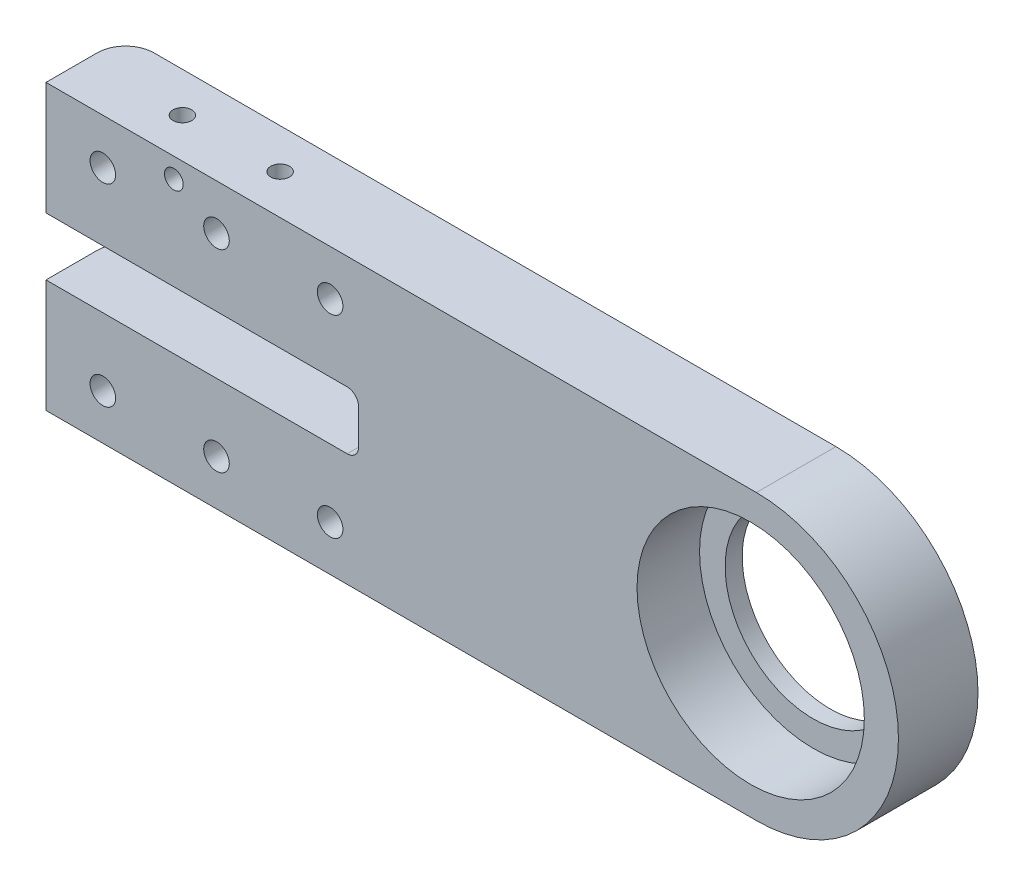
ISO-10303-21;
HEADER;
FILE_DESCRIPTION(('STEP AP214'),'2;1');
FILE_NAME('part.step','',(''),(''),'','','');
FILE_SCHEMA(('AUTOMOTIVE_DESIGN { 1 0 10303 214 1 1 1 1 }'));
ENDSEC;
DATA;
#1=APPLICATION_CONTEXT('core data for automotive mechanical design processes');
#2=APPLICATION_PROTOCOL_DEFINITION('international standard','automotive_design',2000,#1);
#3=PRODUCT_CONTEXT('',#1,'mechanical');
#4=PRODUCT('Part','Part','',(#3));
#5=PRODUCT_RELATED_PRODUCT_CATEGORY('part','',(#4));
#6=PRODUCT_DEFINITION_FORMATION('','',#4);
#7=PRODUCT_DEFINITION_CONTEXT('part definition',#1,'design');
#8=PRODUCT_DEFINITION('design','',#6,#7);
#9=PRODUCT_DEFINITION_SHAPE('','',#8);
#10=(LENGTH_UNIT() NAMED_UNIT(*) SI_UNIT(.MILLI.,.METRE.));
#11=(NAMED_UNIT(*) PLANE_ANGLE_UNIT() SI_UNIT($,.RADIAN.));
#12=(NAMED_UNIT(*) SI_UNIT($,.STERADIAN.) SOLID_ANGLE_UNIT());
#13=UNCERTAINTY_MEASURE_WITH_UNIT(LENGTH_MEASURE(1.E-05),#10,'distance_accuracy_value','');
#14=(GEOMETRIC_REPRESENTATION_CONTEXT(3) GLOBAL_UNCERTAINTY_ASSIGNED_CONTEXT((#13)) GLOBAL_UNIT_ASSIGNED_CONTEXT((#10,
#11,#12)) REPRESENTATION_CONTEXT('',''));
#15=CARTESIAN_POINT('',(0.,0.,0.));
#16=DIRECTION('',(0.,0.,1.));
#17=DIRECTION('',(1.,0.,0.));
#18=AXIS2_PLACEMENT_3D('',#15,#16,#17);
#19=CARTESIAN_POINT('',(0.,-50.,14.));
#20=DIRECTION('',(-1.,0.,0.));
#21=DIRECTION('',(0.,-1.,0.));
#22=AXIS2_PLACEMENT_3D('',#19,#20,#21);
#23=PLANE('',#22);
#24=DIRECTION('',(0.,0.,-1.));
#25=VECTOR('',#24,1.);
#26=CARTESIAN_POINT('',(0.,0.,14.));
#27=LINE('',#26,#25);
#28=CARTESIAN_POINT('',(0.,0.,14.));
#29=VERTEX_POINT('',#28);
#30=CARTESIAN_POINT('',(0.,0.,5.));
#31=VERTEX_POINT('',#30);
#32=EDGE_CURVE('E173',#29,#31,#27,.T.);
#33=ORIENTED_EDGE('',*,*,#32,.T.);
#34=DIRECTION('',(0.,1.,0.));
#35=VECTOR('',#34,1.);
#36=CARTESIAN_POINT('',(0.,-50.,5.));
#37=LINE('',#36,#35);
#38=CARTESIAN_POINT('',(0.,-19.8999999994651,5.));
#39=VERTEX_POINT('',#38);
#40=EDGE_CURVE('E41',#31,#39,#37,.F.);
#41=ORIENTED_EDGE('',*,*,#40,.T.);
#42=DIRECTION('',(0.,0.,1.));
#43=VECTOR('',#42,1.);
#44=CARTESIAN_POINT('',(0.,-19.8999999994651,0.));
#45=LINE('',#44,#43);
#46=CARTESIAN_POINT('',(0.,-19.8999999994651,14.));
#47=VERTEX_POINT('',#46);
#48=EDGE_CURVE('E132',#39,#47,#45,.T.);
#49=ORIENTED_EDGE('',*,*,#48,.T.);
#50=DIRECTION('',(0.,1.,0.));
#51=VECTOR('',#50,1.);
#52=CARTESIAN_POINT('',(0.,-50.,14.));
#53=LINE('',#52,#51);
#54=EDGE_CURVE('E151',#47,#29,#53,.T.);
#55=ORIENTED_EDGE('',*,*,#54,.T.);
#56=EDGE_LOOP('',(#33,#41,#49,#55));
#57=FACE_BOUND('',#56,.T.);
#58=ADVANCED_FACE('F33',(#57),#23,.T.);
#59=CARTESIAN_POINT('',(125.,-25.,14.));
#60=DIRECTION('',(0.,0.,-1.));
#61=DIRECTION('',(-1.,0.,0.));
#62=AXIS2_PLACEMENT_3D('',#59,#60,#61);
#63=CYLINDRICAL_SURFACE('',#62,25.);
#64=CARTESIAN_POINT('',(125.,-25.,0.));
#65=DIRECTION('',(0.,0.,-1.));
#66=DIRECTION('',(-1.,0.,0.));
#67=AXIS2_PLACEMENT_3D('',#64,#65,#66);
#68=CIRCLE('',#67,25.);
#69=CARTESIAN_POINT('',(125.,0.,0.));
#70=VERTEX_POINT('',#69);
#71=CARTESIAN_POINT('',(125.,-50.,0.));
#72=VERTEX_POINT('',#71);
#73=EDGE_CURVE('E160',#70,#72,#68,.T.);
#74=ORIENTED_EDGE('',*,*,#73,.F.);
#75=DIRECTION('',(0.,0.,-1.));
#76=VECTOR('',#75,1.);
#77=CARTESIAN_POINT('',(125.,0.,14.));
#78=LINE('',#77,#76);
#79=CARTESIAN_POINT('',(125.,0.,14.));
#80=VERTEX_POINT('',#79);
#81=EDGE_CURVE('E169',#80,#70,#78,.T.);
#82=ORIENTED_EDGE('',*,*,#81,.F.);
#83=CARTESIAN_POINT('',(125.,-25.,14.));
#84=DIRECTION('',(0.,0.,-1.));
#85=DIRECTION('',(-1.,0.,0.));
#86=AXIS2_PLACEMENT_3D('',#83,#84,#85);
#87=CIRCLE('',#86,25.);
#88=CARTESIAN_POINT('',(125.,-50.,14.));
#89=VERTEX_POINT('',#88);
#90=EDGE_CURVE('E168',#80,#89,#87,.T.);
#91=ORIENTED_EDGE('',*,*,#90,.T.);
#92=DIRECTION('',(0.,0.,-1.));
#93=VECTOR('',#92,1.);
#94=CARTESIAN_POINT('',(125.,-50.,14.));
#95=LINE('',#94,#93);
#96=EDGE_CURVE('E154',#89,#72,#95,.T.);
#97=ORIENTED_EDGE('',*,*,#96,.T.);
#98=EDGE_LOOP('',(#74,#82,#91,#97));
#99=FACE_BOUND('',#98,.T.);
#100=ADVANCED_FACE('F261',(#99),#63,.T.);
#101=CARTESIAN_POINT('',(0.,0.,14.));
#102=DIRECTION('',(0.,1.,0.));
#103=DIRECTION('',(0.,0.,1.));
#104=AXIS2_PLACEMENT_3D('',#101,#102,#103);
#105=PLANE('',#104);
#106=CARTESIAN_POINT('',(17.,0.,7.00000000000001));
#107=DIRECTION('',(0.,1.,0.));
#108=DIRECTION('',(0.,0.,1.));
#109=AXIS2_PLACEMENT_3D('',#106,#107,#108);
#110=CIRCLE('',#109,1.64999999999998);
#111=CARTESIAN_POINT('',(17.,0.,8.64999999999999));
#112=VERTEX_POINT('',#111);
#113=EDGE_CURVE('E368',#112,#112,#110,.T.);
#114=ORIENTED_EDGE('',*,*,#113,.F.);
#115=EDGE_LOOP('',(#114));
#116=FACE_BOUND('',#115,.T.);
#117=CARTESIAN_POINT('',(34.2,0.,7.00000000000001));
#118=DIRECTION('',(0.,1.,0.));
#119=DIRECTION('',(0.,0.,1.));
#120=AXIS2_PLACEMENT_3D('',#117,#118,#119);
#121=CIRCLE('',#120,1.64999999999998);
#122=CARTESIAN_POINT('',(34.2,0.,8.64999999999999));
#123=VERTEX_POINT('',#122);
#124=EDGE_CURVE('E374',#123,#123,#121,.T.);
#125=ORIENTED_EDGE('',*,*,#124,.F.);
#126=EDGE_LOOP('',(#125));
#127=FACE_BOUND('',#126,.T.);
#128=DIRECTION('',(1.,0.,0.));
#129=VECTOR('',#128,1.);
#130=CARTESIAN_POINT('',(0.,0.,0.));
#131=LINE('',#130,#129);
#132=CARTESIAN_POINT('',(5.,0.,0.));
#133=VERTEX_POINT('',#132);
#134=EDGE_CURVE('E166',#133,#70,#131,.T.);
#135=ORIENTED_EDGE('',*,*,#134,.F.);
#136=CARTESIAN_POINT('',(5.,0.,5.));
#137=DIRECTION('',(0.,1.,0.));
#138=DIRECTION('',(0.,0.,1.));
#139=AXIS2_PLACEMENT_3D('',#136,#137,#138);
#140=CIRCLE('',#139,5.);
#141=EDGE_CURVE('E55',#133,#31,#140,.T.);
#142=ORIENTED_EDGE('',*,*,#141,.T.);
#143=ORIENTED_EDGE('',*,*,#32,.F.);
#144=DIRECTION('',(1.,0.,0.));
#145=VECTOR('',#144,1.);
#146=CARTESIAN_POINT('',(0.,0.,14.));
#147=LINE('',#146,#145);
#148=EDGE_CURVE('E150',#29,#80,#147,.T.);
#149=ORIENTED_EDGE('',*,*,#148,.T.);
#150=ORIENTED_EDGE('',*,*,#81,.T.);
#151=EDGE_LOOP('',(#135,#142,#143,#149,#150));
#152=FACE_BOUND('',#151,.T.);
#153=ADVANCED_FACE('F266',(#116,#127,#152),#105,.T.);
#154=DIRECTION('',(0.,0.,1.));
#155=VECTOR('',#154,1.);
#156=CARTESIAN_POINT('',(0.,-30.0999999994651,0.));
#157=LINE('',#156,#155);
#158=CARTESIAN_POINT('',(0.,-30.0999999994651,5.));
#159=VERTEX_POINT('',#158);
#160=CARTESIAN_POINT('',(0.,-30.0999999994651,14.));
#161=VERTEX_POINT('',#160);
#162=EDGE_CURVE('E121',#159,#161,#157,.T.);
#163=ORIENTED_EDGE('',*,*,#162,.F.);
#164=DIRECTION('',(0.,1.,0.));
#165=VECTOR('',#164,1.);
#166=CARTESIAN_POINT('',(0.,-50.,5.));
#167=LINE('',#166,#165);
#168=CARTESIAN_POINT('',(0.,-50.,5.));
#169=VERTEX_POINT('',#168);
#170=EDGE_CURVE('E236',#159,#169,#167,.F.);
#171=ORIENTED_EDGE('',*,*,#170,.T.);
#172=DIRECTION('',(0.,0.,-1.));
#173=VECTOR('',#172,1.);
#174=CARTESIAN_POINT('',(0.,-50.,14.));
#175=LINE('',#174,#173);
#176=CARTESIAN_POINT('',(0.,-50.,14.));
#177=VERTEX_POINT('',#176);
#178=EDGE_CURVE('E149',#177,#169,#175,.T.);
#179=ORIENTED_EDGE('',*,*,#178,.F.);
#180=EDGE_CURVE('E140',#177,#161,#53,.T.);
#181=ORIENTED_EDGE('',*,*,#180,.T.);
#182=EDGE_LOOP('',(#163,#171,#179,#181));
#183=FACE_BOUND('',#182,.T.);
#184=ADVANCED_FACE('F147',(#183),#23,.T.);
#185=CARTESIAN_POINT('',(125.,-50.,14.));
#186=DIRECTION('',(0.,-1.,0.));
#187=DIRECTION('',(0.,0.,-1.));
#188=AXIS2_PLACEMENT_3D('',#185,#186,#187);
#189=PLANE('',#188);
#190=ORIENTED_EDGE('',*,*,#178,.T.);
#191=CARTESIAN_POINT('',(5.00000000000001,-50.,5.));
#192=DIRECTION('',(0.,-1.,0.));
#193=DIRECTION('',(0.,0.,-1.));
#194=AXIS2_PLACEMENT_3D('',#191,#192,#193);
#195=CIRCLE('',#194,5.);
#196=CARTESIAN_POINT('',(5.,-50.,0.));
#197=VERTEX_POINT('',#196);
#198=EDGE_CURVE('E238',#169,#197,#195,.T.);
#199=ORIENTED_EDGE('',*,*,#198,.T.);
#200=DIRECTION('',(-1.,0.,0.));
#201=VECTOR('',#200,1.);
#202=CARTESIAN_POINT('',(125.,-50.,0.));
#203=LINE('',#202,#201);
#204=EDGE_CURVE('E163',#72,#197,#203,.T.);
#205=ORIENTED_EDGE('',*,*,#204,.F.);
#206=ORIENTED_EDGE('',*,*,#96,.F.);
#207=DIRECTION('',(-1.,0.,0.));
#208=VECTOR('',#207,1.);
#209=CARTESIAN_POINT('',(125.,-50.,14.));
#210=LINE('',#209,#208);
#211=EDGE_CURVE('E156',#89,#177,#210,.T.);
#212=ORIENTED_EDGE('',*,*,#211,.T.);
#213=EDGE_LOOP('',(#190,#199,#205,#206,#212));
#214=FACE_BOUND('',#213,.T.);
#215=ADVANCED_FACE('F243',(#214),#189,.T.);
#216=CARTESIAN_POINT('',(125.,-25.,14.));
#217=DIRECTION('',(0.,0.,-1.));
#218=DIRECTION('',(-1.,0.,0.));
#219=AXIS2_PLACEMENT_3D('',#216,#217,#218);
#220=PLANE('',#219);
#221=CARTESIAN_POINT('',(123.999999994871,-24.9999999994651,14.));
#222=DIRECTION('',(0.,0.,1.));
#223=DIRECTION('',(1.,0.,0.));
#224=AXIS2_PLACEMENT_3D('',#221,#222,#223);
#225=CIRCLE('',#224,20.0000000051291);
#226=CARTESIAN_POINT('',(144.,-24.9999999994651,14.));
#227=VERTEX_POINT('',#226);
#228=EDGE_CURVE('E358',#227,#227,#225,.T.);
#229=ORIENTED_EDGE('',*,*,#228,.F.);
#230=EDGE_LOOP('',(#229));
#231=FACE_BOUND('',#230,.T.);
#232=CARTESIAN_POINT('',(22.5,-3.5,14.));
#233=DIRECTION('',(0.,0.,1.));
#234=DIRECTION('',(1.,0.,0.));
#235=AXIS2_PLACEMENT_3D('',#232,#233,#234);
#236=CIRCLE('',#235,1.64999999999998);
#237=CARTESIAN_POINT('',(24.15,-3.5,14.));
#238=VERTEX_POINT('',#237);
#239=EDGE_CURVE('E380',#238,#238,#236,.T.);
#240=ORIENTED_EDGE('',*,*,#239,.F.);
#241=EDGE_LOOP('',(#240));
#242=FACE_BOUND('',#241,.T.);
#243=CARTESIAN_POINT('',(10.,-8.,14.));
#244=DIRECTION('',(0.,0.,-1.));
#245=DIRECTION('',(-1.,0.,0.));
#246=AXIS2_PLACEMENT_3D('',#243,#244,#245);
#247=CIRCLE('',#246,2.24999999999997);
#248=CARTESIAN_POINT('',(7.75000000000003,-8.,14.));
#249=VERTEX_POINT('',#248);
#250=EDGE_CURVE('E386',#249,#249,#247,.T.);
#251=ORIENTED_EDGE('',*,*,#250,.T.);
#252=EDGE_LOOP('',(#251));
#253=FACE_BOUND('',#252,.T.);
#254=CARTESIAN_POINT('',(9.99999999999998,-42.,14.));
#255=DIRECTION('',(0.,0.,-1.));
#256=DIRECTION('',(-1.,0.,0.));
#257=AXIS2_PLACEMENT_3D('',#254,#255,#256);
#258=CIRCLE('',#257,2.24999999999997);
#259=CARTESIAN_POINT('',(7.75000000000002,-42.,14.));
#260=VERTEX_POINT('',#259);
#261=EDGE_CURVE('E389',#260,#260,#258,.T.);
#262=ORIENTED_EDGE('',*,*,#261,.T.);
#263=EDGE_LOOP('',(#262));
#264=FACE_BOUND('',#263,.T.);
#265=CARTESIAN_POINT('',(30.,-42.,14.));
#266=DIRECTION('',(0.,0.,-1.));
#267=DIRECTION('',(-1.,0.,0.));
#268=AXIS2_PLACEMENT_3D('',#265,#266,#267);
#269=CIRCLE('',#268,2.24999999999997);
#270=CARTESIAN_POINT('',(27.75,-42.,14.));
#271=VERTEX_POINT('',#270);
#272=EDGE_CURVE('E392',#271,#271,#269,.T.);
#273=ORIENTED_EDGE('',*,*,#272,.T.);
#274=EDGE_LOOP('',(#273));
#275=FACE_BOUND('',#274,.T.);
#276=CARTESIAN_POINT('',(30.,-8.,14.));
#277=DIRECTION('',(0.,0.,-1.));
#278=DIRECTION('',(-1.,0.,0.));
#279=AXIS2_PLACEMENT_3D('',#276,#277,#278);
#280=CIRCLE('',#279,2.24999999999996);
#281=CARTESIAN_POINT('',(27.75,-8.,14.));
#282=VERTEX_POINT('',#281);
#283=EDGE_CURVE('E395',#282,#282,#280,.T.);
#284=ORIENTED_EDGE('',*,*,#283,.T.);
#285=EDGE_LOOP('',(#284));
#286=FACE_BOUND('',#285,.T.);
#287=CARTESIAN_POINT('',(50.,-8.00000000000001,14.));
#288=DIRECTION('',(0.,0.,-1.));
#289=DIRECTION('',(-1.,0.,0.));
#290=AXIS2_PLACEMENT_3D('',#287,#288,#289);
#291=CIRCLE('',#290,2.24999999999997);
#292=CARTESIAN_POINT('',(47.75,-8.00000000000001,14.));
#293=VERTEX_POINT('',#292);
#294=EDGE_CURVE('E398',#293,#293,#291,.T.);
#295=ORIENTED_EDGE('',*,*,#294,.T.);
#296=EDGE_LOOP('',(#295));
#297=FACE_BOUND('',#296,.T.);
#298=CARTESIAN_POINT('',(50.,-42.,14.));
#299=DIRECTION('',(0.,0.,-1.));
#300=DIRECTION('',(-1.,0.,0.));
#301=AXIS2_PLACEMENT_3D('',#298,#299,#300);
#302=CIRCLE('',#301,2.24999999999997);
#303=CARTESIAN_POINT('',(47.75,-42.,14.));
#304=VERTEX_POINT('',#303);
#305=EDGE_CURVE('E145',#304,#304,#302,.T.);
#306=ORIENTED_EDGE('',*,*,#305,.T.);
#307=EDGE_LOOP('',(#306));
#308=FACE_BOUND('',#307,.T.);
#309=ORIENTED_EDGE('',*,*,#54,.F.);
#310=DIRECTION('',(-1.,0.,0.));
#311=VECTOR('',#310,1.);
#312=CARTESIAN_POINT('',(55.,-19.8999999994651,14.));
#313=LINE('',#312,#311);
#314=CARTESIAN_POINT('',(53.,-19.8999999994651,14.));
#315=VERTEX_POINT('',#314);
#316=EDGE_CURVE('E406',#315,#47,#313,.T.);
#317=ORIENTED_EDGE('',*,*,#316,.F.);
#318=CARTESIAN_POINT('',(53.,-21.8999999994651,14.));
#319=DIRECTION('',(0.,0.,-1.));
#320=DIRECTION('',(-1.,0.,0.));
#321=AXIS2_PLACEMENT_3D('',#318,#319,#320);
#322=CIRCLE('',#321,2.);
#323=CARTESIAN_POINT('',(55.,-21.8999999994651,14.));
#324=VERTEX_POINT('',#323);
#325=EDGE_CURVE('E222',#315,#324,#322,.T.);
#326=ORIENTED_EDGE('',*,*,#325,.T.);
#327=DIRECTION('',(0.,1.,0.));
#328=VECTOR('',#327,1.);
#329=CARTESIAN_POINT('',(55.,-30.0999999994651,14.));
#330=LINE('',#329,#328);
#331=CARTESIAN_POINT('',(55.,-28.0999999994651,14.));
#332=VERTEX_POINT('',#331);
#333=EDGE_CURVE('E144',#332,#324,#330,.T.);
#334=ORIENTED_EDGE('',*,*,#333,.F.);
#335=CARTESIAN_POINT('',(53.,-28.0999999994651,14.));
#336=DIRECTION('',(0.,0.,-1.));
#337=DIRECTION('',(-1.,0.,0.));
#338=AXIS2_PLACEMENT_3D('',#335,#336,#337);
#339=CIRCLE('',#338,2.);
#340=CARTESIAN_POINT('',(53.,-30.0999999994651,14.));
#341=VERTEX_POINT('',#340);
#342=EDGE_CURVE('E143',#332,#341,#339,.T.);
#343=ORIENTED_EDGE('',*,*,#342,.T.);
#344=DIRECTION('',(1.,0.,0.));
#345=VECTOR('',#344,1.);
#346=CARTESIAN_POINT('',(0.,-30.0999999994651,14.));
#347=LINE('',#346,#345);
#348=EDGE_CURVE('E126',#161,#341,#347,.T.);
#349=ORIENTED_EDGE('',*,*,#348,.F.);
#350=ORIENTED_EDGE('',*,*,#180,.F.);
#351=ORIENTED_EDGE('',*,*,#211,.F.);
#352=ORIENTED_EDGE('',*,*,#90,.F.);
#353=ORIENTED_EDGE('',*,*,#148,.F.);
#354=EDGE_LOOP('',(#309,#317,#326,#334,#343,#349,#350,#351,#352,#353));
#355=FACE_BOUND('',#354,.T.);
#356=ADVANCED_FACE('F138',(#231,#242,#253,#264,#275,#286,#297,#308,#355),#220,.F.);
#357=CARTESIAN_POINT('',(125.,-25.,0.));
#358=DIRECTION('',(0.,0.,-1.));
#359=DIRECTION('',(-1.,0.,0.));
#360=AXIS2_PLACEMENT_3D('',#357,#358,#359);
#361=PLANE('',#360);
#362=CARTESIAN_POINT('',(30.,-42.,0.));
#363=DIRECTION('',(0.,0.,-1.));
#364=DIRECTION('',(-1.,0.,0.));
#365=AXIS2_PLACEMENT_3D('',#362,#363,#364);
#366=CIRCLE('',#365,4.70000000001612);
#367=CARTESIAN_POINT('',(25.2999999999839,-42.,0.));
#368=VERTEX_POINT('',#367);
#369=EDGE_CURVE('E194',#368,#368,#366,.F.);
#370=ORIENTED_EDGE('',*,*,#369,.T.);
#371=EDGE_LOOP('',(#370));
#372=FACE_BOUND('',#371,.T.);
#373=CARTESIAN_POINT('',(9.99999999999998,-42.,0.));
#374=DIRECTION('',(0.,0.,-1.));
#375=DIRECTION('',(-1.,0.,0.));
#376=AXIS2_PLACEMENT_3D('',#373,#374,#375);
#377=CIRCLE('',#376,4.70000000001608);
#378=CARTESIAN_POINT('',(5.2999999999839,-42.,0.));
#379=VERTEX_POINT('',#378);
#380=EDGE_CURVE('E191',#379,#379,#377,.F.);
#381=ORIENTED_EDGE('',*,*,#380,.T.);
#382=EDGE_LOOP('',(#381));
#383=FACE_BOUND('',#382,.T.);
#384=CARTESIAN_POINT('',(50.,-42.,0.));
#385=DIRECTION('',(0.,0.,-1.));
#386=DIRECTION('',(-1.,0.,0.));
#387=AXIS2_PLACEMENT_3D('',#384,#385,#386);
#388=CIRCLE('',#387,4.70000000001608);
#389=CARTESIAN_POINT('',(45.2999999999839,-42.,0.));
#390=VERTEX_POINT('',#389);
#391=EDGE_CURVE('E188',#390,#390,#388,.F.);
#392=ORIENTED_EDGE('',*,*,#391,.T.);
#393=EDGE_LOOP('',(#392));
#394=FACE_BOUND('',#393,.T.);
#395=CARTESIAN_POINT('',(30.,-8.,0.));
#396=DIRECTION('',(0.,0.,-1.));
#397=DIRECTION('',(-1.,0.,0.));
#398=AXIS2_PLACEMENT_3D('',#395,#396,#397);
#399=CIRCLE('',#398,4.70000000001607);
#400=CARTESIAN_POINT('',(25.2999999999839,-8.,0.));
#401=VERTEX_POINT('',#400);
#402=EDGE_CURVE('E185',#401,#401,#399,.F.);
#403=ORIENTED_EDGE('',*,*,#402,.T.);
#404=EDGE_LOOP('',(#403));
#405=FACE_BOUND('',#404,.T.);
#406=CARTESIAN_POINT('',(10.,-8.,0.));
#407=DIRECTION('',(0.,0.,-1.));
#408=DIRECTION('',(-1.,0.,0.));
#409=AXIS2_PLACEMENT_3D('',#406,#407,#408);
#410=CIRCLE('',#409,4.70000000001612);
#411=CARTESIAN_POINT('',(5.29999999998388,-8.,0.));
#412=VERTEX_POINT('',#411);
#413=EDGE_CURVE('E182',#412,#412,#410,.F.);
#414=ORIENTED_EDGE('',*,*,#413,.T.);
#415=EDGE_LOOP('',(#414));
#416=FACE_BOUND('',#415,.T.);
#417=CARTESIAN_POINT('',(50.,-8.00000000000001,0.));
#418=DIRECTION('',(0.,0.,-1.));
#419=DIRECTION('',(-1.,0.,0.));
#420=AXIS2_PLACEMENT_3D('',#417,#418,#419);
#421=CIRCLE('',#420,4.70000000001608);
#422=CARTESIAN_POINT('',(45.2999999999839,-8.00000000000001,0.));
#423=VERTEX_POINT('',#422);
#424=EDGE_CURVE('E179',#423,#423,#421,.F.);
#425=ORIENTED_EDGE('',*,*,#424,.T.);
#426=EDGE_LOOP('',(#425));
#427=FACE_BOUND('',#426,.T.);
#428=CARTESIAN_POINT('',(123.999999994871,-24.9999999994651,0.));
#429=DIRECTION('',(0.,0.,1.));
#430=DIRECTION('',(1.,0.,0.));
#431=AXIS2_PLACEMENT_3D('',#428,#429,#430);
#432=CIRCLE('',#431,15.500000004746);
#433=CARTESIAN_POINT('',(139.499999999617,-24.9999999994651,0.));
#434=VERTEX_POINT('',#433);
#435=EDGE_CURVE('E365',#434,#434,#432,.T.);
#436=ORIENTED_EDGE('',*,*,#435,.T.);
#437=EDGE_LOOP('',(#436));
#438=FACE_BOUND('',#437,.T.);
#439=CARTESIAN_POINT('',(22.5,-3.5,0.));
#440=DIRECTION('',(0.,0.,1.));
#441=DIRECTION('',(1.,0.,0.));
#442=AXIS2_PLACEMENT_3D('',#439,#440,#441);
#443=CIRCLE('',#442,1.64999999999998);
#444=CARTESIAN_POINT('',(24.15,-3.5,0.));
#445=VERTEX_POINT('',#444);
#446=EDGE_CURVE('E383',#445,#445,#443,.T.);
#447=ORIENTED_EDGE('',*,*,#446,.T.);
#448=EDGE_LOOP('',(#447));
#449=FACE_BOUND('',#448,.T.);
#450=ORIENTED_EDGE('',*,*,#204,.T.);
#451=DIRECTION('',(0.,1.,0.));
#452=VECTOR('',#451,1.);
#453=CARTESIAN_POINT('',(5.,-25.,0.));
#454=LINE('',#453,#452);
#455=CARTESIAN_POINT('',(5.,-30.0999999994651,0.));
#456=VERTEX_POINT('',#455);
#457=EDGE_CURVE('E232',#197,#456,#454,.T.);
#458=ORIENTED_EDGE('',*,*,#457,.T.);
#459=DIRECTION('',(1.,0.,0.));
#460=VECTOR('',#459,1.);
#461=CARTESIAN_POINT('',(0.,-30.0999999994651,0.));
#462=LINE('',#461,#460);
#463=CARTESIAN_POINT('',(53.,-30.0999999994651,0.));
#464=VERTEX_POINT('',#463);
#465=EDGE_CURVE('E403',#456,#464,#462,.T.);
#466=ORIENTED_EDGE('',*,*,#465,.T.);
#467=CARTESIAN_POINT('',(53.,-28.0999999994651,0.));
#468=DIRECTION('',(0.,0.,-1.));
#469=DIRECTION('',(-1.,0.,0.));
#470=AXIS2_PLACEMENT_3D('',#467,#468,#469);
#471=CIRCLE('',#470,2.);
#472=CARTESIAN_POINT('',(55.,-28.0999999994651,0.));
#473=VERTEX_POINT('',#472);
#474=EDGE_CURVE('E227',#464,#473,#471,.F.);
#475=ORIENTED_EDGE('',*,*,#474,.T.);
#476=DIRECTION('',(0.,1.,0.));
#477=VECTOR('',#476,1.);
#478=CARTESIAN_POINT('',(55.,-30.0999999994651,0.));
#479=LINE('',#478,#477);
#480=CARTESIAN_POINT('',(55.,-21.8999999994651,0.));
#481=VERTEX_POINT('',#480);
#482=EDGE_CURVE('E405',#473,#481,#479,.T.);
#483=ORIENTED_EDGE('',*,*,#482,.T.);
#484=CARTESIAN_POINT('',(53.,-21.8999999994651,0.));
#485=DIRECTION('',(0.,0.,-1.));
#486=DIRECTION('',(-1.,0.,0.));
#487=AXIS2_PLACEMENT_3D('',#484,#485,#486);
#488=CIRCLE('',#487,2.);
#489=CARTESIAN_POINT('',(53.,-19.8999999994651,0.));
#490=VERTEX_POINT('',#489);
#491=EDGE_CURVE('E224',#481,#490,#488,.F.);
#492=ORIENTED_EDGE('',*,*,#491,.T.);
#493=DIRECTION('',(-1.,0.,0.));
#494=VECTOR('',#493,1.);
#495=CARTESIAN_POINT('',(55.,-19.8999999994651,0.));
#496=LINE('',#495,#494);
#497=CARTESIAN_POINT('',(5.,-19.8999999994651,0.));
#498=VERTEX_POINT('',#497);
#499=EDGE_CURVE('E133',#490,#498,#496,.T.);
#500=ORIENTED_EDGE('',*,*,#499,.T.);
#501=DIRECTION('',(0.,1.,0.));
#502=VECTOR('',#501,1.);
#503=CARTESIAN_POINT('',(5.,-25.,0.));
#504=LINE('',#503,#502);
#505=EDGE_CURVE('E229',#498,#133,#504,.T.);
#506=ORIENTED_EDGE('',*,*,#505,.T.);
#507=ORIENTED_EDGE('',*,*,#134,.T.);
#508=ORIENTED_EDGE('',*,*,#73,.T.);
#509=EDGE_LOOP('',(#450,#458,#466,#475,#483,#492,#500,#506,#507,#508));
#510=FACE_BOUND('',#509,.T.);
#511=ADVANCED_FACE('F247',(#372,#383,#394,#405,#416,#427,#438,#449,#510),#361,.T.);
#512=CARTESIAN_POINT('',(55.,-19.8999999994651,0.));
#513=DIRECTION('',(0.,1.,0.));
#514=DIRECTION('',(-1.,0.,0.));
#515=AXIS2_PLACEMENT_3D('',#512,#513,#514);
#516=PLANE('',#515);
#517=CARTESIAN_POINT('',(17.,-19.8999999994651,7.00000000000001));
#518=DIRECTION('',(0.,1.,0.));
#519=DIRECTION('',(-1.,0.,0.));
#520=AXIS2_PLACEMENT_3D('',#517,#518,#519);
#521=CIRCLE('',#520,1.64999999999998);
#522=CARTESIAN_POINT('',(15.35,-19.8999999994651,7.00000000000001));
#523=VERTEX_POINT('',#522);
#524=EDGE_CURVE('E371',#523,#523,#521,.T.);
#525=ORIENTED_EDGE('',*,*,#524,.T.);
#526=EDGE_LOOP('',(#525));
#527=FACE_BOUND('',#526,.T.);
#528=CARTESIAN_POINT('',(34.2,-19.8999999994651,7.00000000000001));
#529=DIRECTION('',(0.,1.,0.));
#530=DIRECTION('',(-1.,0.,0.));
#531=AXIS2_PLACEMENT_3D('',#528,#529,#530);
#532=CIRCLE('',#531,1.64999999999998);
#533=CARTESIAN_POINT('',(32.55,-19.8999999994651,7.00000000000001));
#534=VERTEX_POINT('',#533);
#535=EDGE_CURVE('E377',#534,#534,#532,.T.);
#536=ORIENTED_EDGE('',*,*,#535,.T.);
#537=EDGE_LOOP('',(#536));
#538=FACE_BOUND('',#537,.T.);
#539=ORIENTED_EDGE('',*,*,#48,.F.);
#540=CARTESIAN_POINT('',(5.,-19.8999999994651,5.));
#541=DIRECTION('',(0.,1.,0.));
#542=DIRECTION('',(-1.,0.,0.));
#543=AXIS2_PLACEMENT_3D('',#540,#541,#542);
#544=CIRCLE('',#543,5.);
#545=EDGE_CURVE('E11',#39,#498,#544,.F.);
#546=ORIENTED_EDGE('',*,*,#545,.T.);
#547=ORIENTED_EDGE('',*,*,#499,.F.);
#548=DIRECTION('',(0.,0.,1.));
#549=VECTOR('',#548,1.);
#550=CARTESIAN_POINT('',(53.,-19.8999999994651,14.));
#551=LINE('',#550,#549);
#552=EDGE_CURVE('E212',#490,#315,#551,.T.);
#553=ORIENTED_EDGE('',*,*,#552,.T.);
#554=ORIENTED_EDGE('',*,*,#316,.T.);
#555=EDGE_LOOP('',(#539,#546,#547,#553,#554));
#556=FACE_BOUND('',#555,.T.);
#557=ADVANCED_FACE('F284',(#527,#538,#556),#516,.F.);
#558=CARTESIAN_POINT('',(55.,-30.0999999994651,0.));
#559=DIRECTION('',(1.,0.,0.));
#560=DIRECTION('',(0.,0.,-1.));
#561=AXIS2_PLACEMENT_3D('',#558,#559,#560);
#562=PLANE('',#561);
#563=ORIENTED_EDGE('',*,*,#333,.T.);
#564=DIRECTION('',(0.,0.,1.));
#565=VECTOR('',#564,1.);
#566=CARTESIAN_POINT('',(55.,-21.8999999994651,0.));
#567=LINE('',#566,#565);
#568=EDGE_CURVE('E218',#324,#481,#567,.F.);
#569=ORIENTED_EDGE('',*,*,#568,.T.);
#570=ORIENTED_EDGE('',*,*,#482,.F.);
#571=DIRECTION('',(0.,0.,1.));
#572=VECTOR('',#571,1.);
#573=CARTESIAN_POINT('',(55.,-28.0999999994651,14.));
#574=LINE('',#573,#572);
#575=EDGE_CURVE('E215',#473,#332,#574,.T.);
#576=ORIENTED_EDGE('',*,*,#575,.T.);
#577=EDGE_LOOP('',(#563,#569,#570,#576));
#578=FACE_BOUND('',#577,.T.);
#579=ADVANCED_FACE('F292',(#578),#562,.F.);
#580=CARTESIAN_POINT('',(0.,-30.0999999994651,0.));
#581=DIRECTION('',(0.,-1.,0.));
#582=DIRECTION('',(0.,0.,-1.));
#583=AXIS2_PLACEMENT_3D('',#580,#581,#582);
#584=PLANE('',#583);
#585=ORIENTED_EDGE('',*,*,#465,.F.);
#586=CARTESIAN_POINT('',(5.,-30.0999999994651,5.));
#587=DIRECTION('',(0.,-1.,0.));
#588=DIRECTION('',(0.,0.,-1.));
#589=AXIS2_PLACEMENT_3D('',#586,#587,#588);
#590=CIRCLE('',#589,5.);
#591=EDGE_CURVE('E128',#456,#159,#590,.F.);
#592=ORIENTED_EDGE('',*,*,#591,.T.);
#593=ORIENTED_EDGE('',*,*,#162,.T.);
#594=ORIENTED_EDGE('',*,*,#348,.T.);
#595=DIRECTION('',(0.,0.,1.));
#596=VECTOR('',#595,1.);
#597=CARTESIAN_POINT('',(53.,-30.0999999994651,0.));
#598=LINE('',#597,#596);
#599=EDGE_CURVE('E220',#341,#464,#598,.F.);
#600=ORIENTED_EDGE('',*,*,#599,.T.);
#601=EDGE_LOOP('',(#585,#592,#593,#594,#600));
#602=FACE_BOUND('',#601,.T.);
#603=ADVANCED_FACE('F124',(#602),#584,.F.);
#604=CARTESIAN_POINT('',(50.,-42.,0.));
#605=DIRECTION('',(0.,0.,-1.));
#606=DIRECTION('',(-1.,0.,0.));
#607=AXIS2_PLACEMENT_3D('',#604,#605,#606);
#608=CYLINDRICAL_SURFACE('',#607,2.24999999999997);
#609=CARTESIAN_POINT('',(50.,-42.,2.4499999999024));
#610=DIRECTION('',(0.,0.,-1.));
#611=DIRECTION('',(-1.,0.,0.));
#612=AXIS2_PLACEMENT_3D('',#609,#610,#611);
#613=CIRCLE('',#612,2.24999999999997);
#614=CARTESIAN_POINT('',(47.75,-42.,2.4499999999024));
#615=VERTEX_POINT('',#614);
#616=EDGE_CURVE('E200',#615,#615,#613,.T.);
#617=ORIENTED_EDGE('',*,*,#616,.T.);
#618=EDGE_LOOP('',(#617));
#619=FACE_BOUND('',#618,.T.);
#620=ORIENTED_EDGE('',*,*,#305,.F.);
#621=EDGE_LOOP('',(#620));
#622=FACE_BOUND('',#621,.T.);
#623=ADVANCED_FACE('F291',(#619,#622),#608,.F.);
#624=CARTESIAN_POINT('',(50.,-8.00000000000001,0.));
#625=DIRECTION('',(0.,0.,-1.));
#626=DIRECTION('',(-1.,0.,0.));
#627=AXIS2_PLACEMENT_3D('',#624,#625,#626);
#628=CYLINDRICAL_SURFACE('',#627,2.24999999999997);
#629=CARTESIAN_POINT('',(50.,-8.00000000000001,2.4499999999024));
#630=DIRECTION('',(0.,0.,-1.));
#631=DIRECTION('',(-1.,0.,0.));
#632=AXIS2_PLACEMENT_3D('',#629,#630,#631);
#633=CIRCLE('',#632,2.24999999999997);
#634=CARTESIAN_POINT('',(47.75,-8.00000000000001,2.4499999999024));
#635=VERTEX_POINT('',#634);
#636=EDGE_CURVE('E209',#635,#635,#633,.T.);
#637=ORIENTED_EDGE('',*,*,#636,.T.);
#638=EDGE_LOOP('',(#637));
#639=FACE_BOUND('',#638,.T.);
#640=ORIENTED_EDGE('',*,*,#294,.F.);
#641=EDGE_LOOP('',(#640));
#642=FACE_BOUND('',#641,.T.);
#643=ADVANCED_FACE('F301',(#639,#642),#628,.F.);
#644=CARTESIAN_POINT('',(30.,-8.,0.));
#645=DIRECTION('',(0.,0.,-1.));
#646=DIRECTION('',(-1.,0.,0.));
#647=AXIS2_PLACEMENT_3D('',#644,#645,#646);
#648=CYLINDRICAL_SURFACE('',#647,2.24999999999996);
#649=CARTESIAN_POINT('',(30.,-8.,2.44999999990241));
#650=DIRECTION('',(0.,0.,-1.));
#651=DIRECTION('',(-1.,0.,0.));
#652=AXIS2_PLACEMENT_3D('',#649,#650,#651);
#653=CIRCLE('',#652,2.24999999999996);
#654=CARTESIAN_POINT('',(27.75,-8.,2.44999999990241));
#655=VERTEX_POINT('',#654);
#656=EDGE_CURVE('E203',#655,#655,#653,.T.);
#657=ORIENTED_EDGE('',*,*,#656,.T.);
#658=EDGE_LOOP('',(#657));
#659=FACE_BOUND('',#658,.T.);
#660=ORIENTED_EDGE('',*,*,#283,.F.);
#661=EDGE_LOOP('',(#660));
#662=FACE_BOUND('',#661,.T.);
#663=ADVANCED_FACE('F305',(#659,#662),#648,.F.);
#664=CARTESIAN_POINT('',(30.,-42.,0.));
#665=DIRECTION('',(0.,0.,-1.));
#666=DIRECTION('',(-1.,0.,0.));
#667=AXIS2_PLACEMENT_3D('',#664,#665,#666);
#668=CYLINDRICAL_SURFACE('',#667,2.24999999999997);
#669=CARTESIAN_POINT('',(30.,-42.,2.44999999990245));
#670=DIRECTION('',(0.,0.,-1.));
#671=DIRECTION('',(-1.,0.,0.));
#672=AXIS2_PLACEMENT_3D('',#669,#670,#671);
#673=CIRCLE('',#672,2.24999999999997);
#674=CARTESIAN_POINT('',(27.75,-42.,2.44999999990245));
#675=VERTEX_POINT('',#674);
#676=EDGE_CURVE('E172',#675,#675,#673,.T.);
#677=ORIENTED_EDGE('',*,*,#676,.T.);
#678=EDGE_LOOP('',(#677));
#679=FACE_BOUND('',#678,.T.);
#680=ORIENTED_EDGE('',*,*,#272,.F.);
#681=EDGE_LOOP('',(#680));
#682=FACE_BOUND('',#681,.T.);
#683=ADVANCED_FACE('F309',(#679,#682),#668,.F.);
#684=CARTESIAN_POINT('',(9.99999999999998,-42.,0.));
#685=DIRECTION('',(0.,0.,-1.));
#686=DIRECTION('',(-1.,0.,0.));
#687=AXIS2_PLACEMENT_3D('',#684,#685,#686);
#688=CYLINDRICAL_SURFACE('',#687,2.24999999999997);
#689=CARTESIAN_POINT('',(9.99999999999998,-42.,2.4499999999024));
#690=DIRECTION('',(0.,0.,-1.));
#691=DIRECTION('',(-1.,0.,0.));
#692=AXIS2_PLACEMENT_3D('',#689,#690,#691);
#693=CIRCLE('',#692,2.24999999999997);
#694=CARTESIAN_POINT('',(7.75000000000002,-42.,2.4499999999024));
#695=VERTEX_POINT('',#694);
#696=EDGE_CURVE('E197',#695,#695,#693,.T.);
#697=ORIENTED_EDGE('',*,*,#696,.T.);
#698=EDGE_LOOP('',(#697));
#699=FACE_BOUND('',#698,.T.);
#700=ORIENTED_EDGE('',*,*,#261,.F.);
#701=EDGE_LOOP('',(#700));
#702=FACE_BOUND('',#701,.T.);
#703=ADVANCED_FACE('F313',(#699,#702),#688,.F.);
#704=CARTESIAN_POINT('',(10.,-8.,0.));
#705=DIRECTION('',(0.,0.,-1.));
#706=DIRECTION('',(-1.,0.,0.));
#707=AXIS2_PLACEMENT_3D('',#704,#705,#706);
#708=CYLINDRICAL_SURFACE('',#707,2.24999999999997);
#709=CARTESIAN_POINT('',(10.,-8.,2.44999999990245));
#710=DIRECTION('',(0.,0.,-1.));
#711=DIRECTION('',(-1.,0.,0.));
#712=AXIS2_PLACEMENT_3D('',#709,#710,#711);
#713=CIRCLE('',#712,2.24999999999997);
#714=CARTESIAN_POINT('',(7.75000000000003,-8.,2.44999999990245));
#715=VERTEX_POINT('',#714);
#716=EDGE_CURVE('E206',#715,#715,#713,.T.);
#717=ORIENTED_EDGE('',*,*,#716,.T.);
#718=EDGE_LOOP('',(#717));
#719=FACE_BOUND('',#718,.T.);
#720=ORIENTED_EDGE('',*,*,#250,.F.);
#721=EDGE_LOOP('',(#720));
#722=FACE_BOUND('',#721,.T.);
#723=ADVANCED_FACE('F317',(#719,#722),#708,.F.);
#724=CARTESIAN_POINT('',(22.5,-3.5,14.));
#725=DIRECTION('',(0.,0.,1.));
#726=DIRECTION('',(1.,0.,0.));
#727=AXIS2_PLACEMENT_3D('',#724,#725,#726);
#728=CYLINDRICAL_SURFACE('',#727,1.64999999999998);
#729=ORIENTED_EDGE('',*,*,#446,.F.);
#730=EDGE_LOOP('',(#729));
#731=FACE_BOUND('',#730,.T.);
#732=ORIENTED_EDGE('',*,*,#239,.T.);
#733=EDGE_LOOP('',(#732));
#734=FACE_BOUND('',#733,.T.);
#735=ADVANCED_FACE('F321',(#731,#734),#728,.F.);
#736=CARTESIAN_POINT('',(34.2,0.,7.00000000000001));
#737=DIRECTION('',(0.,1.,0.));
#738=DIRECTION('',(0.,0.,1.));
#739=AXIS2_PLACEMENT_3D('',#736,#737,#738);
#740=CYLINDRICAL_SURFACE('',#739,1.64999999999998);
#741=ORIENTED_EDGE('',*,*,#535,.F.);
#742=EDGE_LOOP('',(#741));
#743=FACE_BOUND('',#742,.T.);
#744=ORIENTED_EDGE('',*,*,#124,.T.);
#745=EDGE_LOOP('',(#744));
#746=FACE_BOUND('',#745,.T.);
#747=ADVANCED_FACE('F325',(#743,#746),#740,.F.);
#748=CARTESIAN_POINT('',(17.,0.,7.00000000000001));
#749=DIRECTION('',(0.,1.,0.));
#750=DIRECTION('',(0.,0.,1.));
#751=AXIS2_PLACEMENT_3D('',#748,#749,#750);
#752=CYLINDRICAL_SURFACE('',#751,1.64999999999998);
#753=ORIENTED_EDGE('',*,*,#524,.F.);
#754=EDGE_LOOP('',(#753));
#755=FACE_BOUND('',#754,.T.);
#756=ORIENTED_EDGE('',*,*,#113,.T.);
#757=EDGE_LOOP('',(#756));
#758=FACE_BOUND('',#757,.T.);
#759=ADVANCED_FACE('F329',(#755,#758),#752,.F.);
#760=CARTESIAN_POINT('',(123.999999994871,-24.9999999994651,14.));
#761=DIRECTION('',(0.,0.,1.));
#762=DIRECTION('',(1.,0.,0.));
#763=AXIS2_PLACEMENT_3D('',#760,#761,#762);
#764=CYLINDRICAL_SURFACE('',#763,15.500000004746);
#765=ORIENTED_EDGE('',*,*,#435,.F.);
#766=EDGE_LOOP('',(#765));
#767=FACE_BOUND('',#766,.T.);
#768=CARTESIAN_POINT('',(123.999999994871,-24.9999999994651,3.));
#769=DIRECTION('',(0.,0.,1.));
#770=DIRECTION('',(1.,0.,0.));
#771=AXIS2_PLACEMENT_3D('',#768,#769,#770);
#772=CIRCLE('',#771,15.500000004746);
#773=CARTESIAN_POINT('',(139.499999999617,-24.9999999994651,3.));
#774=VERTEX_POINT('',#773);
#775=EDGE_CURVE('E360',#774,#774,#772,.T.);
#776=ORIENTED_EDGE('',*,*,#775,.T.);
#777=EDGE_LOOP('',(#776));
#778=FACE_BOUND('',#777,.T.);
#779=ADVANCED_FACE('F333',(#767,#778),#764,.F.);
#780=CARTESIAN_POINT('',(139.499999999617,-24.9999999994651,3.));
#781=DIRECTION('',(0.,0.,-1.));
#782=DIRECTION('',(-1.,0.,0.));
#783=AXIS2_PLACEMENT_3D('',#780,#781,#782);
#784=PLANE('',#783);
#785=ORIENTED_EDGE('',*,*,#775,.F.);
#786=EDGE_LOOP('',(#785));
#787=FACE_BOUND('',#786,.T.);
#788=CARTESIAN_POINT('',(123.999999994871,-24.9999999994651,3.));
#789=DIRECTION('',(0.,0.,1.));
#790=DIRECTION('',(1.,0.,0.));
#791=AXIS2_PLACEMENT_3D('',#788,#789,#790);
#792=CIRCLE('',#791,20.0000000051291);
#793=CARTESIAN_POINT('',(144.,-24.9999999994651,3.));
#794=VERTEX_POINT('',#793);
#795=EDGE_CURVE('E355',#794,#794,#792,.T.);
#796=ORIENTED_EDGE('',*,*,#795,.T.);
#797=EDGE_LOOP('',(#796));
#798=FACE_BOUND('',#797,.T.);
#799=ADVANCED_FACE('F337',(#787,#798),#784,.F.);
#800=CARTESIAN_POINT('',(123.999999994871,-24.9999999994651,14.));
#801=DIRECTION('',(0.,0.,1.));
#802=DIRECTION('',(1.,0.,0.));
#803=AXIS2_PLACEMENT_3D('',#800,#801,#802);
#804=CYLINDRICAL_SURFACE('',#803,20.0000000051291);
#805=ORIENTED_EDGE('',*,*,#795,.F.);
#806=EDGE_LOOP('',(#805));
#807=FACE_BOUND('',#806,.T.);
#808=ORIENTED_EDGE('',*,*,#228,.T.);
#809=EDGE_LOOP('',(#808));
#810=FACE_BOUND('',#809,.T.);
#811=ADVANCED_FACE('F341',(#807,#810),#804,.F.);
#812=CARTESIAN_POINT('',(30.,-42.,2.44999999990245));
#813=DIRECTION('',(0.,0.,-1.));
#814=DIRECTION('',(-1.,0.,0.));
#815=AXIS2_PLACEMENT_3D('',#812,#813,#814);
#816=CONICAL_SURFACE('',#815,2.24999999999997,0.785398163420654);
#817=ORIENTED_EDGE('',*,*,#369,.F.);
#818=EDGE_LOOP('',(#817));
#819=FACE_BOUND('',#818,.T.);
#820=ORIENTED_EDGE('',*,*,#676,.F.);
#821=EDGE_LOOP('',(#820));
#822=FACE_BOUND('',#821,.T.);
#823=ADVANCED_FACE('F344',(#819,#822),#816,.F.);
#824=CARTESIAN_POINT('',(9.99999999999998,-42.,2.4499999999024));
#825=DIRECTION('',(0.,0.,-1.));
#826=DIRECTION('',(-1.,0.,0.));
#827=AXIS2_PLACEMENT_3D('',#824,#825,#826);
#828=CONICAL_SURFACE('',#827,2.24999999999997,0.785398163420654);
#829=CARTESIAN_POINT('',(5.2999999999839,-42.,0.));
#830=CARTESIAN_POINT('',(5.32552083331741,-42.,0.0255208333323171));
#831=CARTESIAN_POINT('',(5.35104166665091,-42.,0.0510416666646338));
#832=CARTESIAN_POINT('',(5.40208333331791,-42.,0.102083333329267));
#833=CARTESIAN_POINT('',(5.42760416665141,-42.,0.127604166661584));
#834=CARTESIAN_POINT('',(5.47864583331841,-42.,0.178645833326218));
#835=CARTESIAN_POINT('',(5.50416666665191,-42.,0.204166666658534));
#836=CARTESIAN_POINT('',(5.55520833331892,-42.,0.255208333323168));
#837=CARTESIAN_POINT('',(5.58072916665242,-42.,0.280729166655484));
#838=CARTESIAN_POINT('',(5.63177083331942,-42.,0.331770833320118));
#839=CARTESIAN_POINT('',(5.65729166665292,-42.,0.357291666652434));
#840=CARTESIAN_POINT('',(5.70833333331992,-42.,0.408333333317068));
#841=CARTESIAN_POINT('',(5.73385416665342,-42.,0.433854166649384));
#842=CARTESIAN_POINT('',(5.78489583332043,-42.,0.484895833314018));
#843=CARTESIAN_POINT('',(5.81041666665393,-42.,0.510416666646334));
#844=CARTESIAN_POINT('',(5.86145833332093,-42.,0.561458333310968));
#845=CARTESIAN_POINT('',(5.88697916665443,-42.,0.586979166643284));
#846=CARTESIAN_POINT('',(5.93802083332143,-42.,0.638020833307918));
#847=CARTESIAN_POINT('',(5.96354166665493,-42.,0.663541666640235));
#848=CARTESIAN_POINT('',(6.01458333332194,-42.,0.714583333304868));
#849=CARTESIAN_POINT('',(6.04010416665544,-42.,0.740104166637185));
#850=CARTESIAN_POINT('',(6.09114583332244,-42.,0.791145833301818));
#851=CARTESIAN_POINT('',(6.11666666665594,-42.,0.816666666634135));
#852=CARTESIAN_POINT('',(6.16770833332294,-42.,0.867708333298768));
#853=CARTESIAN_POINT('',(6.19322916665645,-42.,0.893229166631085));
#854=CARTESIAN_POINT('',(6.24427083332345,-42.,0.944270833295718));
#855=CARTESIAN_POINT('',(6.26979166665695,-42.,0.969791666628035));
#856=CARTESIAN_POINT('',(6.32083333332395,-42.,1.02083333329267));
#857=CARTESIAN_POINT('',(6.34635416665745,-42.,1.04635416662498));
#858=CARTESIAN_POINT('',(6.39739583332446,-42.,1.09739583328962));
#859=CARTESIAN_POINT('',(6.42291666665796,-42.,1.12291666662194));
#860=CARTESIAN_POINT('',(6.47395833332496,-42.,1.17395833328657));
#861=CARTESIAN_POINT('',(6.49947916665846,-42.,1.19947916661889));
#862=CARTESIAN_POINT('',(6.55052083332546,-42.,1.25052083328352));
#863=CARTESIAN_POINT('',(6.57604166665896,-42.,1.27604166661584));
#864=CARTESIAN_POINT('',(6.62708333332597,-42.,1.32708333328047));
#865=CARTESIAN_POINT('',(6.65260416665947,-42.,1.35260416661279));
#866=CARTESIAN_POINT('',(6.70364583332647,-42.,1.40364583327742));
#867=CARTESIAN_POINT('',(6.72916666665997,-42.,1.42916666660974));
#868=CARTESIAN_POINT('',(6.78020833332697,-42.,1.48020833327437));
#869=CARTESIAN_POINT('',(6.80572916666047,-42.,1.50572916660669));
#870=CARTESIAN_POINT('',(6.85677083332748,-42.,1.55677083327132));
#871=CARTESIAN_POINT('',(6.88229166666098,-42.,1.58229166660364));
#872=CARTESIAN_POINT('',(6.93333333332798,-42.,1.63333333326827));
#873=CARTESIAN_POINT('',(6.95885416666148,-42.,1.65885416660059));
#874=CARTESIAN_POINT('',(7.00989583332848,-42.,1.70989583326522));
#875=CARTESIAN_POINT('',(7.03541666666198,-42.,1.73541666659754));
#876=CARTESIAN_POINT('',(7.08645833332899,-42.,1.78645833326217));
#877=CARTESIAN_POINT('',(7.11197916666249,-42.,1.81197916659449));
#878=CARTESIAN_POINT('',(7.16302083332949,-42.,1.86302083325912));
#879=CARTESIAN_POINT('',(7.18854166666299,-42.,1.88854166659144));
#880=CARTESIAN_POINT('',(7.23958333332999,-42.,1.93958333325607));
#881=CARTESIAN_POINT('',(7.26510416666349,-42.,1.96510416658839));
#882=CARTESIAN_POINT('',(7.3161458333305,-42.,2.01614583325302));
#883=CARTESIAN_POINT('',(7.341666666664,-42.,2.04166666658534));
#884=CARTESIAN_POINT('',(7.392708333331,-42.,2.09270833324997));
#885=CARTESIAN_POINT('',(7.4182291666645,-42.,2.11822916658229));
#886=CARTESIAN_POINT('',(7.4692708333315,-42.,2.16927083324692));
#887=CARTESIAN_POINT('',(7.49479166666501,-42.,2.19479166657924));
#888=CARTESIAN_POINT('',(7.54583333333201,-42.,2.24583333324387));
#889=CARTESIAN_POINT('',(7.57135416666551,-42.,2.27135416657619));
#890=CARTESIAN_POINT('',(7.62239583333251,-42.,2.32239583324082));
#891=CARTESIAN_POINT('',(7.64791666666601,-42.,2.34791666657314));
#892=CARTESIAN_POINT('',(7.69895833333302,-42.,2.39895833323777));
#893=CARTESIAN_POINT('',(7.72447916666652,-42.,2.42447916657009));
#894=CARTESIAN_POINT('',(7.75000000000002,-42.,2.4499999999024));
#895=B_SPLINE_CURVE_WITH_KNOTS('',3,(#829,#830,#831,#832,#833,#834,#835,#836,#837,#838,#839,
#840,#841,#842,#843,#844,#845,#846,#847,#848,#849,#850,#851,#852,#853,#854,#855,#856,#857,#858,
#859,#860,#861,#862,#863,#864,#865,#866,#867,#868,#869,#870,#871,#872,#873,#874,#875,#876,#877,
#878,#879,#880,#881,#882,#883,#884,#885,#886,#887,#888,#889,#890,#891,#892,#893,#894),
.UNSPECIFIED.,.F.,.F.,(4,2,2,2,2,2,2,2,2,2,2,2,2,2,2,2,2,2,2,2,2,2,2,2,2,2,2,2,2,2,2,2,4),(0.,
0.108275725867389,0.216551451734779,0.324827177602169,0.433102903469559,0.541378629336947,
0.649654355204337,0.757930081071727,0.866205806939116,0.974481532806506,1.0827572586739,
1.19103298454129,1.29930871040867,1.40758443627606,1.51586016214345,1.62413588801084,
1.73241161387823,1.84068733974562,1.94896306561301,2.0572387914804,2.16551451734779,
2.27379024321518,2.38206596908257,2.49034169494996,2.59861742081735,2.70689314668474,
2.81516887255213,2.92344459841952,3.03172032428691,3.1399960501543,3.24827177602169,
3.35654750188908,3.46482322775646),.UNSPECIFIED.);
#896=EDGE_CURVE('BSEAM349',#379,#695,#895,.T.);
#897=ORIENTED_EDGE('',*,*,#380,.F.);
#898=ORIENTED_EDGE('',*,*,#696,.F.);
#899=ORIENTED_EDGE('',*,*,#896,.T.);
#900=ORIENTED_EDGE('',*,*,#896,.F.);
#901=EDGE_LOOP('',(#897,#899,#898,#900));
#902=FACE_BOUND('',#901,.T.);
#903=ADVANCED_FACE('F349',(#902),#828,.F.);
#904=CARTESIAN_POINT('',(50.,-42.,2.4499999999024));
#905=DIRECTION('',(0.,0.,-1.));
#906=DIRECTION('',(-1.,0.,0.));
#907=AXIS2_PLACEMENT_3D('',#904,#905,#906);
#908=CONICAL_SURFACE('',#907,2.24999999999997,0.785398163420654);
#909=CARTESIAN_POINT('',(45.2999999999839,-42.,0.));
#910=CARTESIAN_POINT('',(45.3255208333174,-42.,0.0255208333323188));
#911=CARTESIAN_POINT('',(45.3510416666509,-42.,0.051041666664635));
#912=CARTESIAN_POINT('',(45.4020833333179,-42.,0.102083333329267));
#913=CARTESIAN_POINT('',(45.4276041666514,-42.,0.127604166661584));
#914=CARTESIAN_POINT('',(45.4786458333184,-42.,0.178645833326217));
#915=CARTESIAN_POINT('',(45.5041666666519,-42.,0.204166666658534));
#916=CARTESIAN_POINT('',(45.5552083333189,-42.,0.255208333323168));
#917=CARTESIAN_POINT('',(45.5807291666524,-42.,0.280729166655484));
#918=CARTESIAN_POINT('',(45.6317708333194,-42.,0.331770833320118));
#919=CARTESIAN_POINT('',(45.6572916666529,-42.,0.357291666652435));
#920=CARTESIAN_POINT('',(45.7083333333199,-42.,0.408333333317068));
#921=CARTESIAN_POINT('',(45.7338541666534,-42.,0.433854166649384));
#922=CARTESIAN_POINT('',(45.7848958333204,-42.,0.484895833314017));
#923=CARTESIAN_POINT('',(45.8104166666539,-42.,0.510416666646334));
#924=CARTESIAN_POINT('',(45.8614583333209,-42.,0.561458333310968));
#925=CARTESIAN_POINT('',(45.8869791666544,-42.,0.586979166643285));
#926=CARTESIAN_POINT('',(45.9380208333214,-42.,0.638020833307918));
#927=CARTESIAN_POINT('',(45.9635416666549,-42.,0.663541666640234));
#928=CARTESIAN_POINT('',(46.014583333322,-42.,0.714583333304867));
#929=CARTESIAN_POINT('',(46.0401041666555,-42.,0.740104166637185));
#930=CARTESIAN_POINT('',(46.0911458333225,-42.,0.791145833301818));
#931=CARTESIAN_POINT('',(46.116666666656,-42.,0.816666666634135));
#932=CARTESIAN_POINT('',(46.167708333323,-42.,0.867708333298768));
#933=CARTESIAN_POINT('',(46.1932291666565,-42.,0.893229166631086));
#934=CARTESIAN_POINT('',(46.2442708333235,-42.,0.944270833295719));
#935=CARTESIAN_POINT('',(46.269791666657,-42.,0.969791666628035));
#936=CARTESIAN_POINT('',(46.320833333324,-42.,1.02083333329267));
#937=CARTESIAN_POINT('',(46.3463541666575,-42.,1.04635416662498));
#938=CARTESIAN_POINT('',(46.3973958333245,-42.,1.09739583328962));
#939=CARTESIAN_POINT('',(46.422916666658,-42.,1.12291666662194));
#940=CARTESIAN_POINT('',(46.473958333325,-42.,1.17395833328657));
#941=CARTESIAN_POINT('',(46.4994791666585,-42.,1.19947916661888));
#942=CARTESIAN_POINT('',(46.5505208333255,-42.,1.25052083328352));
#943=CARTESIAN_POINT('',(46.576041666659,-42.,1.27604166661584));
#944=CARTESIAN_POINT('',(46.627083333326,-42.,1.32708333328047));
#945=CARTESIAN_POINT('',(46.6526041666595,-42.,1.35260416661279));
#946=CARTESIAN_POINT('',(46.7036458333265,-42.,1.40364583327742));
#947=CARTESIAN_POINT('',(46.72916666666,-42.,1.42916666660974));
#948=CARTESIAN_POINT('',(46.780208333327,-42.,1.48020833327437));
#949=CARTESIAN_POINT('',(46.8057291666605,-42.,1.50572916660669));
#950=CARTESIAN_POINT('',(46.8567708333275,-42.,1.55677083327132));
#951=CARTESIAN_POINT('',(46.882291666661,-42.,1.58229166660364));
#952=CARTESIAN_POINT('',(46.933333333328,-42.,1.63333333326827));
#953=CARTESIAN_POINT('',(46.9588541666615,-42.,1.65885416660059));
#954=CARTESIAN_POINT('',(47.0098958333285,-42.,1.70989583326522));
#955=CARTESIAN_POINT('',(47.035416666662,-42.,1.73541666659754));
#956=CARTESIAN_POINT('',(47.086458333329,-42.,1.78645833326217));
#957=CARTESIAN_POINT('',(47.1119791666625,-42.,1.81197916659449));
#958=CARTESIAN_POINT('',(47.1630208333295,-42.,1.86302083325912));
#959=CARTESIAN_POINT('',(47.188541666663,-42.,1.88854166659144));
#960=CARTESIAN_POINT('',(47.23958333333,-42.,1.93958333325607));
#961=CARTESIAN_POINT('',(47.2651041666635,-42.,1.96510416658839));
#962=CARTESIAN_POINT('',(47.3161458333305,-42.,2.01614583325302));
#963=CARTESIAN_POINT('',(47.341666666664,-42.,2.04166666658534));
#964=CARTESIAN_POINT('',(47.392708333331,-42.,2.09270833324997));
#965=CARTESIAN_POINT('',(47.4182291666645,-42.,2.11822916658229));
#966=CARTESIAN_POINT('',(47.4692708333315,-42.,2.16927083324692));
#967=CARTESIAN_POINT('',(47.494791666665,-42.,2.19479166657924));
#968=CARTESIAN_POINT('',(47.545833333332,-42.,2.24583333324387));
#969=CARTESIAN_POINT('',(47.5713541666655,-42.,2.27135416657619));
#970=CARTESIAN_POINT('',(47.6223958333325,-42.,2.32239583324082));
#971=CARTESIAN_POINT('',(47.647916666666,-42.,2.34791666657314));
#972=CARTESIAN_POINT('',(47.698958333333,-42.,2.39895833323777));
#973=CARTESIAN_POINT('',(47.7244791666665,-42.,2.42447916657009));
#974=CARTESIAN_POINT('',(47.75,-42.,2.4499999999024));
#975=B_SPLINE_CURVE_WITH_KNOTS('',3,(#909,#910,#911,#912,#913,#914,#915,#916,#917,#918,#919,
#920,#921,#922,#923,#924,#925,#926,#927,#928,#929,#930,#931,#932,#933,#934,#935,#936,#937,#938,
#939,#940,#941,#942,#943,#944,#945,#946,#947,#948,#949,#950,#951,#952,#953,#954,#955,#956,#957,
#958,#959,#960,#961,#962,#963,#964,#965,#966,#967,#968,#969,#970,#971,#972,#973,#974),
.UNSPECIFIED.,.F.,.F.,(4,2,2,2,2,2,2,2,2,2,2,2,2,2,2,2,2,2,2,2,2,2,2,2,2,2,2,2,2,2,2,2,4),(0.,
0.108275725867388,0.216551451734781,0.32482717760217,0.433102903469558,0.541378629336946,
0.649654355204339,0.757930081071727,0.866205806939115,0.974481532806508,1.0827572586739,
1.19103298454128,1.29930871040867,1.40758443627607,1.51586016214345,1.62413588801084,
1.73241161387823,1.84068733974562,1.94896306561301,2.0572387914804,2.16551451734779,
2.27379024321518,2.38206596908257,2.49034169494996,2.59861742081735,2.70689314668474,
2.81516887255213,2.92344459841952,3.03172032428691,3.13999605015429,3.24827177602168,
3.35654750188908,3.46482322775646),.UNSPECIFIED.);
#976=EDGE_CURVE('BSEAM446',#390,#615,#975,.T.);
#977=ORIENTED_EDGE('',*,*,#391,.F.);
#978=ORIENTED_EDGE('',*,*,#616,.F.);
#979=ORIENTED_EDGE('',*,*,#976,.T.);
#980=ORIENTED_EDGE('',*,*,#976,.F.);
#981=EDGE_LOOP('',(#977,#979,#978,#980));
#982=FACE_BOUND('',#981,.T.);
#983=ADVANCED_FACE('F446',(#982),#908,.F.);
#984=CARTESIAN_POINT('',(30.,-8.,2.44999999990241));
#985=DIRECTION('',(0.,0.,-1.));
#986=DIRECTION('',(-1.,0.,0.));
#987=AXIS2_PLACEMENT_3D('',#984,#985,#986);
#988=CONICAL_SURFACE('',#987,2.24999999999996,0.785398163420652);
#989=ORIENTED_EDGE('',*,*,#402,.F.);
#990=EDGE_LOOP('',(#989));
#991=FACE_BOUND('',#990,.T.);
#992=ORIENTED_EDGE('',*,*,#656,.F.);
#993=EDGE_LOOP('',(#992));
#994=FACE_BOUND('',#993,.T.);
#995=ADVANCED_FACE('F442',(#991,#994),#988,.F.);
#996=CARTESIAN_POINT('',(10.,-8.,2.44999999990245));
#997=DIRECTION('',(0.,0.,-1.));
#998=DIRECTION('',(-1.,0.,0.));
#999=AXIS2_PLACEMENT_3D('',#996,#997,#998);
#1000=CONICAL_SURFACE('',#999,2.24999999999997,0.785398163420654);
#1001=ORIENTED_EDGE('',*,*,#413,.F.);
#1002=EDGE_LOOP('',(#1001));
#1003=FACE_BOUND('',#1002,.T.);
#1004=ORIENTED_EDGE('',*,*,#716,.F.);
#1005=EDGE_LOOP('',(#1004));
#1006=FACE_BOUND('',#1005,.T.);
#1007=ADVANCED_FACE('F436',(#1003,#1006),#1000,.F.);
#1008=CARTESIAN_POINT('',(50.,-8.00000000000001,2.4499999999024));
#1009=DIRECTION('',(0.,0.,-1.));
#1010=DIRECTION('',(-1.,0.,0.));
#1011=AXIS2_PLACEMENT_3D('',#1008,#1009,#1010);
#1012=CONICAL_SURFACE('',#1011,2.24999999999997,0.785398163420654);
#1013=CARTESIAN_POINT('',(45.2999999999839,-8.00000000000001,0.));
#1014=CARTESIAN_POINT('',(45.3255208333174,-8.00000000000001,0.0255208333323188));
#1015=CARTESIAN_POINT('',(45.3510416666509,-8.00000000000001,0.051041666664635));
#1016=CARTESIAN_POINT('',(45.4020833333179,-8.00000000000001,0.102083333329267));
#1017=CARTESIAN_POINT('',(45.4276041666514,-8.00000000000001,0.127604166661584));
#1018=CARTESIAN_POINT('',(45.4786458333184,-8.00000000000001,0.178645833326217));
#1019=CARTESIAN_POINT('',(45.5041666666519,-8.00000000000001,0.204166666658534));
#1020=CARTESIAN_POINT('',(45.5552083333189,-8.00000000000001,0.255208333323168));
#1021=CARTESIAN_POINT('',(45.5807291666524,-8.00000000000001,0.280729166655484));
#1022=CARTESIAN_POINT('',(45.6317708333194,-8.00000000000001,0.331770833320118));
#1023=CARTESIAN_POINT('',(45.6572916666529,-8.00000000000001,0.357291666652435));
#1024=CARTESIAN_POINT('',(45.7083333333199,-8.00000000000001,0.408333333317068));
#1025=CARTESIAN_POINT('',(45.7338541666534,-8.00000000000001,0.433854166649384));
#1026=CARTESIAN_POINT('',(45.7848958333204,-8.00000000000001,0.484895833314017));
#1027=CARTESIAN_POINT('',(45.8104166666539,-8.00000000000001,0.510416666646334));
#1028=CARTESIAN_POINT('',(45.8614583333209,-8.00000000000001,0.561458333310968));
#1029=CARTESIAN_POINT('',(45.8869791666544,-8.00000000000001,0.586979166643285));
#1030=CARTESIAN_POINT('',(45.9380208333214,-8.00000000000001,0.638020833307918));
#1031=CARTESIAN_POINT('',(45.9635416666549,-8.00000000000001,0.663541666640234));
#1032=CARTESIAN_POINT('',(46.014583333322,-8.00000000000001,0.714583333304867));
#1033=CARTESIAN_POINT('',(46.0401041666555,-8.00000000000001,0.740104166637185));
#1034=CARTESIAN_POINT('',(46.0911458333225,-8.00000000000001,0.791145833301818));
#1035=CARTESIAN_POINT('',(46.116666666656,-8.00000000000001,0.816666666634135));
#1036=CARTESIAN_POINT('',(46.167708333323,-8.00000000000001,0.867708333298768));
#1037=CARTESIAN_POINT('',(46.1932291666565,-8.00000000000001,0.893229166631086));
#1038=CARTESIAN_POINT('',(46.2442708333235,-8.00000000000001,0.944270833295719));
#1039=CARTESIAN_POINT('',(46.269791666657,-8.00000000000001,0.969791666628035));
#1040=CARTESIAN_POINT('',(46.320833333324,-8.00000000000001,1.02083333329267));
#1041=CARTESIAN_POINT('',(46.3463541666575,-8.00000000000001,1.04635416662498));
#1042=CARTESIAN_POINT('',(46.3973958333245,-8.00000000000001,1.09739583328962));
#1043=CARTESIAN_POINT('',(46.422916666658,-8.00000000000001,1.12291666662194));
#1044=CARTESIAN_POINT('',(46.473958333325,-8.00000000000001,1.17395833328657));
#1045=CARTESIAN_POINT('',(46.4994791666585,-8.00000000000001,1.19947916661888));
#1046=CARTESIAN_POINT('',(46.5505208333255,-8.00000000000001,1.25052083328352));
#1047=CARTESIAN_POINT('',(46.576041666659,-8.00000000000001,1.27604166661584));
#1048=CARTESIAN_POINT('',(46.627083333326,-8.00000000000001,1.32708333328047));
#1049=CARTESIAN_POINT('',(46.6526041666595,-8.00000000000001,1.35260416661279));
#1050=CARTESIAN_POINT('',(46.7036458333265,-8.00000000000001,1.40364583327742));
#1051=CARTESIAN_POINT('',(46.72916666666,-8.00000000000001,1.42916666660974));
#1052=CARTESIAN_POINT('',(46.780208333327,-8.00000000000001,1.48020833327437));
#1053=CARTESIAN_POINT('',(46.8057291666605,-8.00000000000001,1.50572916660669));
#1054=CARTESIAN_POINT('',(46.8567708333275,-8.00000000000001,1.55677083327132));
#1055=CARTESIAN_POINT('',(46.882291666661,-8.00000000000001,1.58229166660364));
#1056=CARTESIAN_POINT('',(46.933333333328,-8.00000000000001,1.63333333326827));
#1057=CARTESIAN_POINT('',(46.9588541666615,-8.00000000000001,1.65885416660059));
#1058=CARTESIAN_POINT('',(47.0098958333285,-8.00000000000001,1.70989583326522));
#1059=CARTESIAN_POINT('',(47.035416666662,-8.00000000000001,1.73541666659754));
#1060=CARTESIAN_POINT('',(47.086458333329,-8.00000000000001,1.78645833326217));
#1061=CARTESIAN_POINT('',(47.1119791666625,-8.00000000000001,1.81197916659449));
#1062=CARTESIAN_POINT('',(47.1630208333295,-8.00000000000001,1.86302083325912));
#1063=CARTESIAN_POINT('',(47.188541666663,-8.00000000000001,1.88854166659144));
#1064=CARTESIAN_POINT('',(47.23958333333,-8.00000000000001,1.93958333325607));
#1065=CARTESIAN_POINT('',(47.2651041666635,-8.00000000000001,1.96510416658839));
#1066=CARTESIAN_POINT('',(47.3161458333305,-8.00000000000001,2.01614583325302));
#1067=CARTESIAN_POINT('',(47.341666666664,-8.00000000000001,2.04166666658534));
#1068=CARTESIAN_POINT('',(47.392708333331,-8.00000000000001,2.09270833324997));
#1069=CARTESIAN_POINT('',(47.4182291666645,-8.00000000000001,2.11822916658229));
#1070=CARTESIAN_POINT('',(47.4692708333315,-8.00000000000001,2.16927083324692));
#1071=CARTESIAN_POINT('',(47.494791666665,-8.00000000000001,2.19479166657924));
#1072=CARTESIAN_POINT('',(47.545833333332,-8.00000000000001,2.24583333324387));
#1073=CARTESIAN_POINT('',(47.5713541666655,-8.00000000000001,2.27135416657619));
#1074=CARTESIAN_POINT('',(47.6223958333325,-8.00000000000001,2.32239583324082));
#1075=CARTESIAN_POINT('',(47.647916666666,-8.00000000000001,2.34791666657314));
#1076=CARTESIAN_POINT('',(47.698958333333,-8.00000000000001,2.39895833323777));
#1077=CARTESIAN_POINT('',(47.7244791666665,-8.00000000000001,2.42447916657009));
#1078=CARTESIAN_POINT('',(47.75,-8.00000000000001,2.4499999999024));
#1079=B_SPLINE_CURVE_WITH_KNOTS('',3,(#1013,#1014,#1015,#1016,#1017,#1018,#1019,#1020,#1021,
#1022,#1023,#1024,#1025,#1026,#1027,#1028,#1029,#1030,#1031,#1032,#1033,#1034,#1035,#1036,#1037,
#1038,#1039,#1040,#1041,#1042,#1043,#1044,#1045,#1046,#1047,#1048,#1049,#1050,#1051,#1052,#1053,
#1054,#1055,#1056,#1057,#1058,#1059,#1060,#1061,#1062,#1063,#1064,#1065,#1066,#1067,#1068,#1069,
#1070,#1071,#1072,#1073,#1074,#1075,#1076,#1077,#1078),.UNSPECIFIED.,.F.,.F.,(4,2,2,2,2,2,2,2,2,
2,2,2,2,2,2,2,2,2,2,2,2,2,2,2,2,2,2,2,2,2,2,2,4),(0.,0.108275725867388,0.216551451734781,
0.32482717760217,0.433102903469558,0.541378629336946,0.649654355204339,0.757930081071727,
0.866205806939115,0.974481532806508,1.0827572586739,1.19103298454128,1.29930871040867,
1.40758443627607,1.51586016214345,1.62413588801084,1.73241161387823,1.84068733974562,
1.94896306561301,2.0572387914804,2.16551451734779,2.27379024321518,2.38206596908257,
2.49034169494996,2.59861742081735,2.70689314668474,2.81516887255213,2.92344459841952,
3.03172032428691,3.13999605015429,3.24827177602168,3.35654750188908,3.46482322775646),.UNSPECIFIED.);
#1080=EDGE_CURVE('BSEAM431',#423,#635,#1079,.T.);
#1081=ORIENTED_EDGE('',*,*,#424,.F.);
#1082=ORIENTED_EDGE('',*,*,#636,.F.);
#1083=ORIENTED_EDGE('',*,*,#1080,.T.);
#1084=ORIENTED_EDGE('',*,*,#1080,.F.);
#1085=EDGE_LOOP('',(#1081,#1083,#1082,#1084));
#1086=FACE_BOUND('',#1085,.T.);
#1087=ADVANCED_FACE('F431',(#1086),#1012,.F.);
#1088=CARTESIAN_POINT('',(53.,-21.8999999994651,0.));
#1089=DIRECTION('',(0.,0.,-1.));
#1090=DIRECTION('',(-1.,0.,0.));
#1091=AXIS2_PLACEMENT_3D('',#1088,#1089,#1090);
#1092=CYLINDRICAL_SURFACE('',#1091,2.);
#1093=ORIENTED_EDGE('',*,*,#491,.F.);
#1094=ORIENTED_EDGE('',*,*,#568,.F.);
#1095=ORIENTED_EDGE('',*,*,#325,.F.);
#1096=ORIENTED_EDGE('',*,*,#552,.F.);
#1097=EDGE_LOOP('',(#1093,#1094,#1095,#1096));
#1098=FACE_BOUND('',#1097,.T.);
#1099=ADVANCED_FACE('F257',(#1098),#1092,.F.);
#1100=CARTESIAN_POINT('',(53.,-28.0999999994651,0.));
#1101=DIRECTION('',(0.,0.,-1.));
#1102=DIRECTION('',(-1.,0.,0.));
#1103=AXIS2_PLACEMENT_3D('',#1100,#1101,#1102);
#1104=CYLINDRICAL_SURFACE('',#1103,2.);
#1105=ORIENTED_EDGE('',*,*,#474,.F.);
#1106=ORIENTED_EDGE('',*,*,#599,.F.);
#1107=ORIENTED_EDGE('',*,*,#342,.F.);
#1108=ORIENTED_EDGE('',*,*,#575,.F.);
#1109=EDGE_LOOP('',(#1105,#1106,#1107,#1108));
#1110=FACE_BOUND('',#1109,.T.);
#1111=ADVANCED_FACE('F251',(#1110),#1104,.F.);
#1112=CARTESIAN_POINT('',(5.,-25.,5.));
#1113=DIRECTION('',(0.,1.,0.));
#1114=DIRECTION('',(-1.,0.,0.));
#1115=AXIS2_PLACEMENT_3D('',#1112,#1113,#1114);
#1116=CYLINDRICAL_SURFACE('',#1115,5.);
#1117=ORIENTED_EDGE('',*,*,#198,.F.);
#1118=ORIENTED_EDGE('',*,*,#170,.F.);
#1119=ORIENTED_EDGE('',*,*,#591,.F.);
#1120=ORIENTED_EDGE('',*,*,#457,.F.);
#1121=EDGE_LOOP('',(#1117,#1118,#1119,#1120));
#1122=FACE_BOUND('',#1121,.T.);
#1123=ADVANCED_FACE('F249',(#1122),#1116,.T.);
#1124=CARTESIAN_POINT('',(5.,-25.,5.));
#1125=DIRECTION('',(0.,1.,0.));
#1126=DIRECTION('',(-1.,0.,0.));
#1127=AXIS2_PLACEMENT_3D('',#1124,#1125,#1126);
#1128=CYLINDRICAL_SURFACE('',#1127,5.);
#1129=ORIENTED_EDGE('',*,*,#545,.F.);
#1130=ORIENTED_EDGE('',*,*,#40,.F.);
#1131=ORIENTED_EDGE('',*,*,#141,.F.);
#1132=ORIENTED_EDGE('',*,*,#505,.F.);
#1133=EDGE_LOOP('',(#1129,#1130,#1131,#1132));
#1134=FACE_BOUND('',#1133,.T.);
#1135=ADVANCED_FACE('F35',(#1134),#1128,.T.);
#1136=CLOSED_SHELL('',(#58,#100,#153,#184,#215,#356,#511,#557,#579,#603,#623,#643,#663,#683,
#703,#723,#735,#747,#759,#779,#799,#811,#823,#903,#983,#995,#1007,#1087,#1099,#1111,#1123,#1135));
#1137=MANIFOLD_SOLID_BREP('B2',#1136);
#1138=ADVANCED_BREP_SHAPE_REPRESENTATION('',(#18,#1137),#14);
#1139=SHAPE_DEFINITION_REPRESENTATION(#9,#1138);
ENDSEC;
END-ISO-10303-21;
